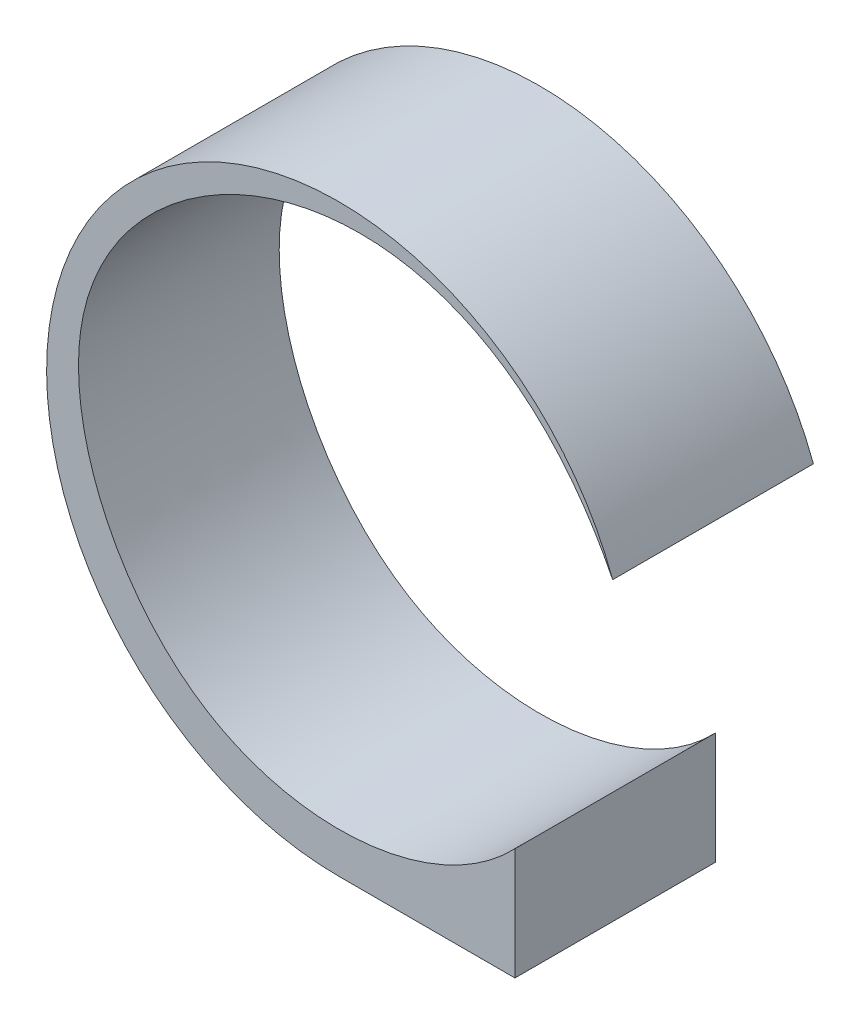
from build123d import *

# Parameters (mm, degrees)
BOSS_EXTRUDE1_DEPTH = 11.43


with BuildPart() as part:
    # Sketch1 → Boss-Extrude1 (new body)
    with BuildSketch(Plane.XY):
        with BuildLine():
            Line((31.75, 13.5255), (41.783, 13.5255))
            Line((41.783, 13.5255), (41.783, 19.901402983))
            add(Edge.make_bspline(
                [(41.783, 19.901402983), (37.388377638, 15.300461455), (22.50974328, 13.827894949), (9.767144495, 41.809558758), (38.910377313, 52.896860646), (47.34791313, 35.949975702)],
                knots=[0, 0, 0, 0, 0.262420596, 0.499517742, 1, 1, 1, 1], degree=3))
            ThreePointArc((47.34791313, 35.949975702), (18.092108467, 39.662593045), (31.75, 13.5255))
        make_face()
    extrude(amount=BOSS_EXTRUDE1_DEPTH)


solid = part.part
